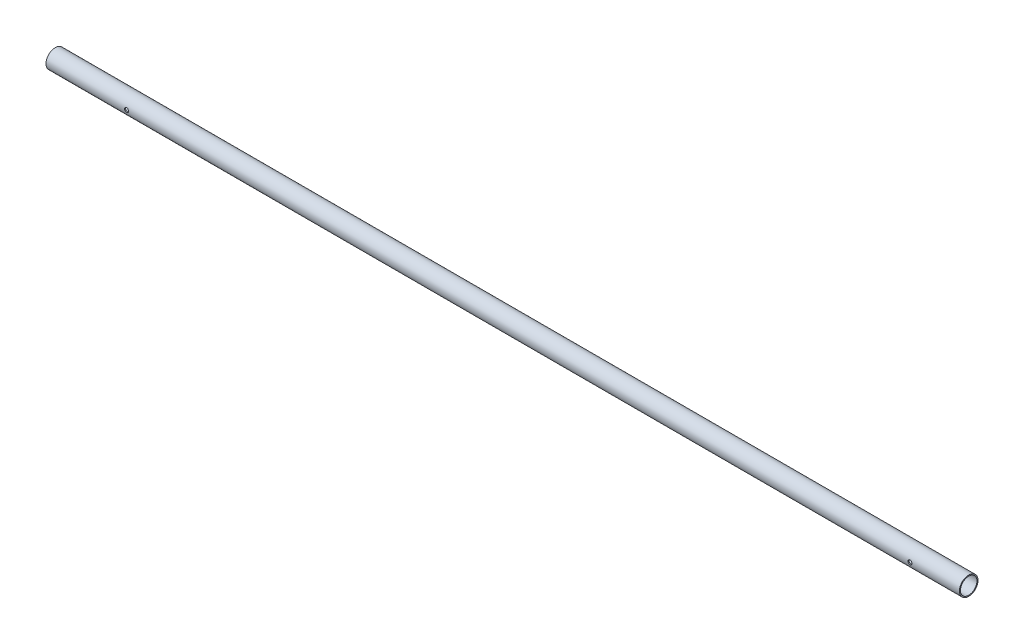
ISO-10303-21;
HEADER;
FILE_DESCRIPTION(('STEP AP214'),'2;1');
FILE_NAME('part.step','',(''),(''),'','','');
FILE_SCHEMA(('AUTOMOTIVE_DESIGN { 1 0 10303 214 1 1 1 1 }'));
ENDSEC;
DATA;
#1=APPLICATION_CONTEXT('core data for automotive mechanical design processes');
#2=APPLICATION_PROTOCOL_DEFINITION('international standard','automotive_design',2000,#1);
#3=PRODUCT_CONTEXT('',#1,'mechanical');
#4=PRODUCT('Part','Part','',(#3));
#5=PRODUCT_RELATED_PRODUCT_CATEGORY('part','',(#4));
#6=PRODUCT_DEFINITION_FORMATION('','',#4);
#7=PRODUCT_DEFINITION_CONTEXT('part definition',#1,'design');
#8=PRODUCT_DEFINITION('design','',#6,#7);
#9=PRODUCT_DEFINITION_SHAPE('','',#8);
#10=(LENGTH_UNIT() NAMED_UNIT(*) SI_UNIT(.MILLI.,.METRE.));
#11=(NAMED_UNIT(*) PLANE_ANGLE_UNIT() SI_UNIT($,.RADIAN.));
#12=(NAMED_UNIT(*) SI_UNIT($,.STERADIAN.) SOLID_ANGLE_UNIT());
#13=UNCERTAINTY_MEASURE_WITH_UNIT(LENGTH_MEASURE(1.E-05),#10,'distance_accuracy_value','');
#14=(GEOMETRIC_REPRESENTATION_CONTEXT(3) GLOBAL_UNCERTAINTY_ASSIGNED_CONTEXT((#13)) GLOBAL_UNIT_ASSIGNED_CONTEXT((#10,
#11,#12)) REPRESENTATION_CONTEXT('',''));
#15=CARTESIAN_POINT('',(0.,0.,0.));
#16=DIRECTION('',(0.,0.,1.));
#17=DIRECTION('',(1.,0.,0.));
#18=AXIS2_PLACEMENT_3D('',#15,#16,#17);
#19=CARTESIAN_POINT('',(936.625,0.,0.));
#20=DIRECTION('',(1.,0.,0.));
#21=DIRECTION('',(0.,0.,-1.));
#22=AXIS2_PLACEMENT_3D('',#19,#20,#21);
#23=PLANE('',#22);
#24=CARTESIAN_POINT('',(936.625,0.,0.));
#25=DIRECTION('',(1.,0.,0.));
#26=DIRECTION('',(0.,0.,-1.));
#27=AXIS2_PLACEMENT_3D('',#24,#25,#26);
#28=CIRCLE('',#27,19.05);
#29=CARTESIAN_POINT('',(936.625,0.,-19.05));
#30=VERTEX_POINT('',#29);
#31=EDGE_CURVE('E10',#30,#30,#28,.T.);
#32=ORIENTED_EDGE('',*,*,#31,.T.);
#33=EDGE_LOOP('',(#32));
#34=FACE_BOUND('',#33,.T.);
#35=CARTESIAN_POINT('',(936.625,0.,0.));
#36=DIRECTION('',(1.,0.,0.));
#37=DIRECTION('',(0.,0.,-1.));
#38=AXIS2_PLACEMENT_3D('',#35,#36,#37);
#39=CIRCLE('',#38,16.9418);
#40=CARTESIAN_POINT('',(936.625,0.,-16.9418));
#41=VERTEX_POINT('',#40);
#42=EDGE_CURVE('E46',#41,#41,#39,.T.);
#43=ORIENTED_EDGE('',*,*,#42,.F.);
#44=EDGE_LOOP('',(#43));
#45=FACE_BOUND('',#44,.T.);
#46=ADVANCED_FACE('F28',(#34,#45),#23,.T.);
#47=CARTESIAN_POINT('',(-936.625,0.,0.));
#48=DIRECTION('',(1.,0.,0.));
#49=DIRECTION('',(0.,0.,-1.));
#50=AXIS2_PLACEMENT_3D('',#47,#48,#49);
#51=PLANE('',#50);
#52=CARTESIAN_POINT('',(-936.625,0.,0.));
#53=DIRECTION('',(1.,0.,0.));
#54=DIRECTION('',(0.,0.,-1.));
#55=AXIS2_PLACEMENT_3D('',#52,#53,#54);
#56=CIRCLE('',#55,19.05);
#57=CARTESIAN_POINT('',(-936.625,0.,-19.05));
#58=VERTEX_POINT('',#57);
#59=EDGE_CURVE('E41',#58,#58,#56,.T.);
#60=ORIENTED_EDGE('',*,*,#59,.F.);
#61=EDGE_LOOP('',(#60));
#62=FACE_BOUND('',#61,.T.);
#63=CARTESIAN_POINT('',(-936.625,0.,0.));
#64=DIRECTION('',(1.,0.,0.));
#65=DIRECTION('',(0.,0.,-1.));
#66=AXIS2_PLACEMENT_3D('',#63,#64,#65);
#67=CIRCLE('',#66,16.9418);
#68=CARTESIAN_POINT('',(-936.625,0.,-16.9418));
#69=VERTEX_POINT('',#68);
#70=EDGE_CURVE('E49',#69,#69,#67,.T.);
#71=ORIENTED_EDGE('',*,*,#70,.T.);
#72=EDGE_LOOP('',(#71));
#73=FACE_BOUND('',#72,.T.);
#74=ADVANCED_FACE('F96',(#62,#73),#51,.F.);
#75=CARTESIAN_POINT('',(936.625,0.,0.));
#76=DIRECTION('',(-1.,0.,0.));
#77=DIRECTION('',(0.,0.,1.));
#78=AXIS2_PLACEMENT_3D('',#75,#76,#77);
#79=CYLINDRICAL_SURFACE('',#78,19.05);
#80=CARTESIAN_POINT('',(839.1906,0.,-19.05));
#81=CARTESIAN_POINT('',(839.190592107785,0.23103670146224,-19.0499957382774));
#82=CARTESIAN_POINT('',(839.171314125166,0.462168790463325,-19.0457543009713));
#83=CARTESIAN_POINT('',(839.09479154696,0.917867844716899,-19.0292440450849));
#84=CARTESIAN_POINT('',(839.037519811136,1.1424299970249,-19.0169694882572));
#85=CARTESIAN_POINT('',(838.886889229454,1.57833749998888,-18.9857596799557));
#86=CARTESIAN_POINT('',(838.7935680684,1.78969638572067,-18.966831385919));
#87=CARTESIAN_POINT('',(838.573607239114,2.19374922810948,-18.9243570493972));
#88=CARTESIAN_POINT('',(838.446968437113,2.38644366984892,-18.9008111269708));
#89=CARTESIAN_POINT('',(838.161817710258,2.75079571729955,-18.8512587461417));
#90=CARTESIAN_POINT('',(838.002873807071,2.92211112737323,-18.8252217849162));
#91=CARTESIAN_POINT('',(837.658552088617,3.23587497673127,-18.7738368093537));
#92=CARTESIAN_POINT('',(837.47317191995,3.37832084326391,-18.748488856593));
#93=CARTESIAN_POINT('',(837.078710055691,3.63181171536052,-18.7010511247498));
#94=CARTESIAN_POINT('',(836.869389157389,3.74249246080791,-18.6790004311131));
#95=CARTESIAN_POINT('',(836.434557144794,3.92697472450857,-18.641091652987));
#96=CARTESIAN_POINT('',(836.209047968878,4.00078064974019,-18.6252328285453));
#97=CARTESIAN_POINT('',(835.751952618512,4.10828734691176,-18.6018140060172));
#98=CARTESIAN_POINT('',(835.520515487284,4.14259395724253,-18.5941287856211));
#99=CARTESIAN_POINT('',(835.055052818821,4.17201195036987,-18.5875512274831));
#100=CARTESIAN_POINT('',(834.821027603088,4.167128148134,-18.5886578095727));
#101=CARTESIAN_POINT('',(834.361535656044,4.11879150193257,-18.5994254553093));
#102=CARTESIAN_POINT('',(834.135990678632,4.07604242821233,-18.6089304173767));
#103=CARTESIAN_POINT('',(833.695353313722,3.95430370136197,-18.6351770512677));
#104=CARTESIAN_POINT('',(833.480261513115,3.87531201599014,-18.651919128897));
#105=CARTESIAN_POINT('',(833.064657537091,3.68268403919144,-18.6909074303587));
#106=CARTESIAN_POINT('',(832.864274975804,3.56877710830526,-18.7131963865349));
#107=CARTESIAN_POINT('',(832.485207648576,3.30974234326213,-18.7607408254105));
#108=CARTESIAN_POINT('',(832.306525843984,3.1646102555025,-18.7859967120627));
#109=CARTESIAN_POINT('',(831.971880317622,2.84351942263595,-18.8372990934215));
#110=CARTESIAN_POINT('',(831.816491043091,2.66696223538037,-18.8633508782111));
#111=CARTESIAN_POINT('',(831.537433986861,2.28999988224,-18.9128125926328));
#112=CARTESIAN_POINT('',(831.413766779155,2.08959428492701,-18.9362224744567));
#113=CARTESIAN_POINT('',(831.201522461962,1.66992291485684,-18.9778386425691));
#114=CARTESIAN_POINT('',(831.11302059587,1.45061790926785,-18.9960337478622));
#115=CARTESIAN_POINT('',(830.974283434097,0.999762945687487,-19.0250871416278));
#116=CARTESIAN_POINT('',(830.924042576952,0.768214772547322,-19.035946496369));
#117=CARTESIAN_POINT('',(830.864089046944,0.304373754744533,-19.0489530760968));
#118=CARTESIAN_POINT('',(830.853591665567,0.0721869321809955,-19.0512689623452));
#119=CARTESIAN_POINT('',(830.871296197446,-0.390622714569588,-19.0474002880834));
#120=CARTESIAN_POINT('',(830.899495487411,-0.621245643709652,-19.0412163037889));
#121=CARTESIAN_POINT('',(830.993142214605,-1.07178121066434,-19.021149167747));
#122=CARTESIAN_POINT('',(831.058178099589,-1.29178351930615,-19.0073511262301));
#123=CARTESIAN_POINT('',(831.223195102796,-1.71775649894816,-18.9736002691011));
#124=CARTESIAN_POINT('',(831.323179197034,-1.92372597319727,-18.9536469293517));
#125=CARTESIAN_POINT('',(831.556889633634,-2.31903151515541,-18.909382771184));
#126=CARTESIAN_POINT('',(831.69107699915,-2.50808836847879,-18.8850138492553));
#127=CARTESIAN_POINT('',(831.988777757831,-2.86128245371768,-18.8347403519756));
#128=CARTESIAN_POINT('',(832.152294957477,-3.02541644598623,-18.8088355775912));
#129=CARTESIAN_POINT('',(832.507614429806,-3.32720776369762,-18.7578275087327));
#130=CARTESIAN_POINT('',(832.699882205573,-3.46432173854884,-18.7327477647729));
#131=CARTESIAN_POINT('',(833.105177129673,-3.70431636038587,-18.6867742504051));
#132=CARTESIAN_POINT('',(833.318203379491,-3.8071984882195,-18.665880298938));
#133=CARTESIAN_POINT('',(833.757826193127,-3.9751144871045,-18.630843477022));
#134=CARTESIAN_POINT('',(833.984338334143,-4.04036109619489,-18.6166627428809));
#135=CARTESIAN_POINT('',(834.445461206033,-4.13177717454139,-18.5965896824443));
#136=CARTESIAN_POINT('',(834.680070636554,-4.15795288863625,-18.5906960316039));
#137=CARTESIAN_POINT('',(835.145249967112,-4.17021848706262,-18.587947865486));
#138=CARTESIAN_POINT('',(835.375796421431,-4.15716987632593,-18.5908990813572));
#139=CARTESIAN_POINT('',(835.831320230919,-4.09328311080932,-18.6050687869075));
#140=CARTESIAN_POINT('',(836.056297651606,-4.04244540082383,-18.6162871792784));
#141=CARTESIAN_POINT('',(836.493613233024,-3.90483964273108,-18.6456325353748));
#142=CARTESIAN_POINT('',(836.705992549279,-3.81819690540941,-18.6637353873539));
#143=CARTESIAN_POINT('',(837.113328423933,-3.61154823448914,-18.704819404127));
#144=CARTESIAN_POINT('',(837.308283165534,-3.49153882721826,-18.7278010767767));
#145=CARTESIAN_POINT('',(837.679482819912,-3.21870570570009,-18.7766336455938));
#146=CARTESIAN_POINT('',(837.855270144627,-3.06526800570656,-18.8025331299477));
#147=CARTESIAN_POINT('',(838.178884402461,-2.73117812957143,-18.8539565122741));
#148=CARTESIAN_POINT('',(838.326704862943,-2.55051967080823,-18.8794803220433));
#149=CARTESIAN_POINT('',(838.59202373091,-2.16429423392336,-18.9276689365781));
#150=CARTESIAN_POINT('',(838.709104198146,-1.95843470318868,-18.9502923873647));
#151=CARTESIAN_POINT('',(838.906816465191,-1.52950710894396,-18.9897163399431));
#152=CARTESIAN_POINT('',(838.987478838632,-1.30645366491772,-19.0065217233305));
#153=CARTESIAN_POINT('',(839.095686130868,-0.902647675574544,-19.0294168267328));
#154=CARTESIAN_POINT('',(839.13121092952,-0.724079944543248,-19.0370877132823));
#155=CARTESIAN_POINT('',(839.178670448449,-0.363694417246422,-19.0473808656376));
#156=CARTESIAN_POINT('',(839.190606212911,-0.181876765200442,-19.0500033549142));
#157=CARTESIAN_POINT('',(839.1906,0.,-19.05));
#158=B_SPLINE_CURVE_WITH_KNOTS('',3,(#80,#81,#82,#83,#84,#85,#86,#87,#88,#89,#90,#91,#92,#93,
#94,#95,#96,#97,#98,#99,#100,#101,#102,#103,#104,#105,#106,#107,#108,#109,#110,#111,#112,#113,
#114,#115,#116,#117,#118,#119,#120,#121,#122,#123,#124,#125,#126,#127,#128,#129,#130,#131,#132,
#133,#134,#135,#136,#137,#138,#139,#140,#141,#142,#143,#144,#145,#146,#147,#148,#149,#150,#151,
#152,#153,#154,#155,#156,#157),.UNSPECIFIED.,.T.,.F.,(4,2,2,2,2,2,2,2,2,2,2,2,2,2,2,2,2,2,2,2,2,
2,2,2,2,2,2,2,2,2,2,2,2,2,2,2,2,2,4),(0.,0.692444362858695,1.3853838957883,2.07760100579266,
2.76980012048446,3.47194888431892,4.17416019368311,4.88412865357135,5.59401224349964,
6.29285621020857,6.99161431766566,7.67765149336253,8.36372714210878,9.05526135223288,
9.74688982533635,10.4534659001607,11.1600547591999,11.8681474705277,12.5761372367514,
13.2700730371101,13.9639617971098,14.6502469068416,15.33659047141,16.0327255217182,
16.7289509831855,17.4380000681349,18.1470184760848,18.8519887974,19.5568464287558,
20.2463368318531,20.9358191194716,21.6229085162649,22.3100694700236,23.0111136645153,
23.7123199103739,24.4226166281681,25.1323159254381,25.6774462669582,26.2225524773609),.UNSPECIFIED.);
#159=CARTESIAN_POINT('',(839.1906,0.,-19.05));
#160=VERTEX_POINT('',#159);
#161=EDGE_CURVE('E163',#160,#160,#158,.T.);
#162=ORIENTED_EDGE('',*,*,#161,.T.);
#163=EDGE_LOOP('',(#162));
#164=FACE_BOUND('',#163,.T.);
#165=CARTESIAN_POINT('',(839.1906,0.,19.05));
#166=CARTESIAN_POINT('',(839.190592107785,-0.23103670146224,19.0499957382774));
#167=CARTESIAN_POINT('',(839.171314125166,-0.462168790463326,19.0457543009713));
#168=CARTESIAN_POINT('',(839.09479154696,-0.917867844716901,19.0292440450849));
#169=CARTESIAN_POINT('',(839.037519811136,-1.1424299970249,19.0169694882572));
#170=CARTESIAN_POINT('',(838.886889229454,-1.57833749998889,18.9857596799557));
#171=CARTESIAN_POINT('',(838.7935680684,-1.78969638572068,18.966831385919));
#172=CARTESIAN_POINT('',(838.573607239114,-2.19374922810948,18.9243570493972));
#173=CARTESIAN_POINT('',(838.446968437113,-2.38644366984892,18.9008111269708));
#174=CARTESIAN_POINT('',(838.161817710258,-2.75079571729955,18.8512587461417));
#175=CARTESIAN_POINT('',(838.002873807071,-2.92211112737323,18.8252217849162));
#176=CARTESIAN_POINT('',(837.658552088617,-3.23587497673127,18.7738368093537));
#177=CARTESIAN_POINT('',(837.47317191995,-3.37832084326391,18.748488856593));
#178=CARTESIAN_POINT('',(837.078710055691,-3.63181171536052,18.7010511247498));
#179=CARTESIAN_POINT('',(836.869389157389,-3.74249246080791,18.6790004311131));
#180=CARTESIAN_POINT('',(836.434557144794,-3.92697472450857,18.641091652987));
#181=CARTESIAN_POINT('',(836.209047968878,-4.00078064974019,18.6252328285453));
#182=CARTESIAN_POINT('',(835.751952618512,-4.10828734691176,18.6018140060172));
#183=CARTESIAN_POINT('',(835.520515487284,-4.14259395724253,18.5941287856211));
#184=CARTESIAN_POINT('',(835.055052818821,-4.17201195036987,18.5875512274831));
#185=CARTESIAN_POINT('',(834.821027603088,-4.167128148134,18.5886578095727));
#186=CARTESIAN_POINT('',(834.361535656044,-4.11879150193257,18.5994254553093));
#187=CARTESIAN_POINT('',(834.135990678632,-4.07604242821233,18.6089304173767));
#188=CARTESIAN_POINT('',(833.695353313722,-3.95430370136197,18.6351770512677));
#189=CARTESIAN_POINT('',(833.480261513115,-3.87531201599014,18.651919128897));
#190=CARTESIAN_POINT('',(833.064657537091,-3.68268403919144,18.6909074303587));
#191=CARTESIAN_POINT('',(832.864274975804,-3.56877710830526,18.7131963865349));
#192=CARTESIAN_POINT('',(832.485207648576,-3.30974234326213,18.7607408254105));
#193=CARTESIAN_POINT('',(832.306525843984,-3.1646102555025,18.7859967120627));
#194=CARTESIAN_POINT('',(831.971880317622,-2.84351942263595,18.8372990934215));
#195=CARTESIAN_POINT('',(831.816491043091,-2.66696223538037,18.8633508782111));
#196=CARTESIAN_POINT('',(831.537433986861,-2.28999988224,18.9128125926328));
#197=CARTESIAN_POINT('',(831.413766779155,-2.08959428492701,18.9362224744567));
#198=CARTESIAN_POINT('',(831.201522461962,-1.66992291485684,18.9778386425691));
#199=CARTESIAN_POINT('',(831.11302059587,-1.45061790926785,18.9960337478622));
#200=CARTESIAN_POINT('',(830.974283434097,-0.999762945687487,19.0250871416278));
#201=CARTESIAN_POINT('',(830.924042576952,-0.768214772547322,19.035946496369));
#202=CARTESIAN_POINT('',(830.864089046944,-0.304373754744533,19.0489530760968));
#203=CARTESIAN_POINT('',(830.853591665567,-0.0721869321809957,19.0512689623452));
#204=CARTESIAN_POINT('',(830.871296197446,0.390622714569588,19.0474002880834));
#205=CARTESIAN_POINT('',(830.899495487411,0.621245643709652,19.0412163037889));
#206=CARTESIAN_POINT('',(830.993142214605,1.07178121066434,19.021149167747));
#207=CARTESIAN_POINT('',(831.058178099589,1.29178351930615,19.0073511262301));
#208=CARTESIAN_POINT('',(831.223195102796,1.71775649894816,18.9736002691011));
#209=CARTESIAN_POINT('',(831.323179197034,1.92372597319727,18.9536469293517));
#210=CARTESIAN_POINT('',(831.556889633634,2.31903151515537,18.909382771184));
#211=CARTESIAN_POINT('',(831.69107699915,2.50808836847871,18.8850138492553));
#212=CARTESIAN_POINT('',(831.988777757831,2.86128245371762,18.8347403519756));
#213=CARTESIAN_POINT('',(832.152294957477,3.0254164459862,18.8088355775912));
#214=CARTESIAN_POINT('',(832.507614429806,3.32720776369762,18.7578275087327));
#215=CARTESIAN_POINT('',(832.699882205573,3.46432173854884,18.7327477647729));
#216=CARTESIAN_POINT('',(833.105177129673,3.70431636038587,18.6867742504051));
#217=CARTESIAN_POINT('',(833.318203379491,3.8071984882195,18.665880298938));
#218=CARTESIAN_POINT('',(833.757826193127,3.9751144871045,18.630843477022));
#219=CARTESIAN_POINT('',(833.984338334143,4.04036109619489,18.6166627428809));
#220=CARTESIAN_POINT('',(834.445461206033,4.13177717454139,18.5965896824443));
#221=CARTESIAN_POINT('',(834.680070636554,4.15795288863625,18.5906960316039));
#222=CARTESIAN_POINT('',(835.145249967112,4.17021848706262,18.587947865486));
#223=CARTESIAN_POINT('',(835.375796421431,4.15716987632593,18.5908990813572));
#224=CARTESIAN_POINT('',(835.831320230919,4.09328311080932,18.6050687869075));
#225=CARTESIAN_POINT('',(836.056297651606,4.04244540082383,18.6162871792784));
#226=CARTESIAN_POINT('',(836.493613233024,3.90483964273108,18.6456325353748));
#227=CARTESIAN_POINT('',(836.705992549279,3.81819690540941,18.6637353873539));
#228=CARTESIAN_POINT('',(837.113328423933,3.61154823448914,18.704819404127));
#229=CARTESIAN_POINT('',(837.308283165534,3.49153882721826,18.7278010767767));
#230=CARTESIAN_POINT('',(837.679482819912,3.21870570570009,18.7766336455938));
#231=CARTESIAN_POINT('',(837.855270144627,3.06526800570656,18.8025331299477));
#232=CARTESIAN_POINT('',(838.178884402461,2.73117812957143,18.8539565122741));
#233=CARTESIAN_POINT('',(838.326704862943,2.55051967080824,18.8794803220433));
#234=CARTESIAN_POINT('',(838.59202373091,2.16429423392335,18.9276689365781));
#235=CARTESIAN_POINT('',(838.709104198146,1.95843470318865,18.9502923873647));
#236=CARTESIAN_POINT('',(838.906816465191,1.52950710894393,18.9897163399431));
#237=CARTESIAN_POINT('',(838.987478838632,1.30645366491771,19.0065217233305));
#238=CARTESIAN_POINT('',(839.095686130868,0.902647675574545,19.0294168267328));
#239=CARTESIAN_POINT('',(839.13121092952,0.724079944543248,19.0370877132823));
#240=CARTESIAN_POINT('',(839.178670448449,0.363694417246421,19.0473808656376));
#241=CARTESIAN_POINT('',(839.190606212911,0.181876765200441,19.0500033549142));
#242=CARTESIAN_POINT('',(839.1906,0.,19.05));
#243=B_SPLINE_CURVE_WITH_KNOTS('',3,(#165,#166,#167,#168,#169,#170,#171,#172,#173,#174,#175,
#176,#177,#178,#179,#180,#181,#182,#183,#184,#185,#186,#187,#188,#189,#190,#191,#192,#193,#194,
#195,#196,#197,#198,#199,#200,#201,#202,#203,#204,#205,#206,#207,#208,#209,#210,#211,#212,#213,
#214,#215,#216,#217,#218,#219,#220,#221,#222,#223,#224,#225,#226,#227,#228,#229,#230,#231,#232,
#233,#234,#235,#236,#237,#238,#239,#240,#241,#242),.UNSPECIFIED.,.T.,.F.,(4,2,2,2,2,2,2,2,2,2,2,
2,2,2,2,2,2,2,2,2,2,2,2,2,2,2,2,2,2,2,2,2,2,2,2,2,2,2,4),(0.,0.692444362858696,1.3853838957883,
2.07760100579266,2.76980012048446,3.47194888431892,4.17416019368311,4.88412865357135,
5.59401224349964,6.29285621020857,6.99161431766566,7.67765149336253,8.36372714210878,
9.05526135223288,9.74688982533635,10.4534659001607,11.1600547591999,11.8681474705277,
12.5761372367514,13.2700730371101,13.9639617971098,14.6502469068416,15.33659047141,
16.0327255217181,16.7289509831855,17.4380000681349,18.1470184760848,18.8519887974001,
19.5568464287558,20.2463368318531,20.9358191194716,21.6229085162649,22.3100694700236,
23.0111136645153,23.7123199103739,24.4226166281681,25.1323159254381,25.6774462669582,
26.2225524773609),.UNSPECIFIED.);
#244=CARTESIAN_POINT('',(839.1906,0.,19.05));
#245=VERTEX_POINT('',#244);
#246=EDGE_CURVE('E59',#245,#245,#243,.T.);
#247=ORIENTED_EDGE('',*,*,#246,.T.);
#248=EDGE_LOOP('',(#247));
#249=FACE_BOUND('',#248,.T.);
#250=CARTESIAN_POINT('',(-767.3594,0.,-19.05));
#251=CARTESIAN_POINT('',(-767.359407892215,0.23103670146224,-19.0499957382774));
#252=CARTESIAN_POINT('',(-767.378685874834,0.462168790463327,-19.0457543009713));
#253=CARTESIAN_POINT('',(-767.45520845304,0.917867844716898,-19.0292440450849));
#254=CARTESIAN_POINT('',(-767.512480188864,1.14242999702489,-19.0169694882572));
#255=CARTESIAN_POINT('',(-767.663110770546,1.57833749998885,-18.9857596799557));
#256=CARTESIAN_POINT('',(-767.7564319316,1.78969638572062,-18.966831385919));
#257=CARTESIAN_POINT('',(-767.976392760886,2.19374922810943,-18.9243570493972));
#258=CARTESIAN_POINT('',(-768.103031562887,2.38644366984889,-18.9008111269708));
#259=CARTESIAN_POINT('',(-768.388182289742,2.75079571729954,-18.8512587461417));
#260=CARTESIAN_POINT('',(-768.547126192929,2.92211112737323,-18.8252217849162));
#261=CARTESIAN_POINT('',(-768.891447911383,3.23587497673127,-18.7738368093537));
#262=CARTESIAN_POINT('',(-769.076828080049,3.37832084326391,-18.748488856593));
#263=CARTESIAN_POINT('',(-769.471289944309,3.63181171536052,-18.7010511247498));
#264=CARTESIAN_POINT('',(-769.680610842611,3.74249246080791,-18.6790004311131));
#265=CARTESIAN_POINT('',(-770.115442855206,3.92697472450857,-18.641091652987));
#266=CARTESIAN_POINT('',(-770.340952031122,4.00078064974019,-18.6252328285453));
#267=CARTESIAN_POINT('',(-770.798047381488,4.10828734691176,-18.6018140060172));
#268=CARTESIAN_POINT('',(-771.029484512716,4.14259395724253,-18.5941287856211));
#269=CARTESIAN_POINT('',(-771.494947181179,4.17201195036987,-18.5875512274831));
#270=CARTESIAN_POINT('',(-771.728972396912,4.167128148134,-18.5886578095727));
#271=CARTESIAN_POINT('',(-772.188464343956,4.11879150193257,-18.5994254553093));
#272=CARTESIAN_POINT('',(-772.414009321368,4.07604242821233,-18.6089304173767));
#273=CARTESIAN_POINT('',(-772.854646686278,3.95430370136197,-18.6351770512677));
#274=CARTESIAN_POINT('',(-773.069738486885,3.87531201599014,-18.651919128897));
#275=CARTESIAN_POINT('',(-773.485342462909,3.68268403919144,-18.6909074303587));
#276=CARTESIAN_POINT('',(-773.685725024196,3.56877710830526,-18.7131963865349));
#277=CARTESIAN_POINT('',(-774.064792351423,3.30974234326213,-18.7607408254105));
#278=CARTESIAN_POINT('',(-774.243474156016,3.1646102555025,-18.7859967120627));
#279=CARTESIAN_POINT('',(-774.578119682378,2.84351942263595,-18.8372990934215));
#280=CARTESIAN_POINT('',(-774.733508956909,2.66696223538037,-18.8633508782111));
#281=CARTESIAN_POINT('',(-775.012566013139,2.28999988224,-18.9128125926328));
#282=CARTESIAN_POINT('',(-775.136233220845,2.08959428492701,-18.9362224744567));
#283=CARTESIAN_POINT('',(-775.348477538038,1.66992291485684,-18.9778386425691));
#284=CARTESIAN_POINT('',(-775.43697940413,1.45061790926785,-18.9960337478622));
#285=CARTESIAN_POINT('',(-775.575716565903,0.999762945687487,-19.0250871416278));
#286=CARTESIAN_POINT('',(-775.625957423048,0.768214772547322,-19.035946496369));
#287=CARTESIAN_POINT('',(-775.685910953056,0.304373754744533,-19.0489530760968));
#288=CARTESIAN_POINT('',(-775.696408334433,0.0721869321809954,-19.0512689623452));
#289=CARTESIAN_POINT('',(-775.678703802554,-0.390622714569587,-19.0474002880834));
#290=CARTESIAN_POINT('',(-775.650504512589,-0.621245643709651,-19.0412163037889));
#291=CARTESIAN_POINT('',(-775.556857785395,-1.07178121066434,-19.021149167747));
#292=CARTESIAN_POINT('',(-775.491821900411,-1.29178351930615,-19.0073511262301));
#293=CARTESIAN_POINT('',(-775.326804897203,-1.71775649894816,-18.9736002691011));
#294=CARTESIAN_POINT('',(-775.226820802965,-1.92372597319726,-18.9536469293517));
#295=CARTESIAN_POINT('',(-774.993110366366,-2.31903151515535,-18.909382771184));
#296=CARTESIAN_POINT('',(-774.85892300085,-2.50808836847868,-18.8850138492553));
#297=CARTESIAN_POINT('',(-774.561222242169,-2.86128245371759,-18.8347403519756));
#298=CARTESIAN_POINT('',(-774.397705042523,-3.02541644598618,-18.8088355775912));
#299=CARTESIAN_POINT('',(-774.042385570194,-3.32720776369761,-18.7578275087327));
#300=CARTESIAN_POINT('',(-773.850117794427,-3.46432173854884,-18.7327477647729));
#301=CARTESIAN_POINT('',(-773.444822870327,-3.70431636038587,-18.6867742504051));
#302=CARTESIAN_POINT('',(-773.231796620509,-3.8071984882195,-18.665880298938));
#303=CARTESIAN_POINT('',(-772.792173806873,-3.9751144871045,-18.630843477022));
#304=CARTESIAN_POINT('',(-772.565661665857,-4.04036109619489,-18.6166627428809));
#305=CARTESIAN_POINT('',(-772.104538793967,-4.13177717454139,-18.5965896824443));
#306=CARTESIAN_POINT('',(-771.869929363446,-4.15795288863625,-18.5906960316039));
#307=CARTESIAN_POINT('',(-771.404750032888,-4.17021848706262,-18.587947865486));
#308=CARTESIAN_POINT('',(-771.174203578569,-4.15716987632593,-18.5908990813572));
#309=CARTESIAN_POINT('',(-770.718679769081,-4.09328311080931,-18.6050687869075));
#310=CARTESIAN_POINT('',(-770.493702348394,-4.04244540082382,-18.6162871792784));
#311=CARTESIAN_POINT('',(-770.056386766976,-3.90483964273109,-18.6456325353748));
#312=CARTESIAN_POINT('',(-769.844007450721,-3.81819690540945,-18.6637353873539));
#313=CARTESIAN_POINT('',(-769.436671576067,-3.61154823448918,-18.704819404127));
#314=CARTESIAN_POINT('',(-769.241716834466,-3.49153882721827,-18.7278010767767));
#315=CARTESIAN_POINT('',(-768.870517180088,-3.21870570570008,-18.7766336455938));
#316=CARTESIAN_POINT('',(-768.694729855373,-3.06526800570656,-18.8025331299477));
#317=CARTESIAN_POINT('',(-768.371115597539,-2.73117812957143,-18.8539565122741));
#318=CARTESIAN_POINT('',(-768.223295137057,-2.55051967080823,-18.8794803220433));
#319=CARTESIAN_POINT('',(-767.95797626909,-2.16429423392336,-18.9276689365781));
#320=CARTESIAN_POINT('',(-767.840895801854,-1.95843470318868,-18.9502923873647));
#321=CARTESIAN_POINT('',(-767.643183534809,-1.52950710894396,-18.9897163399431));
#322=CARTESIAN_POINT('',(-767.562521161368,-1.30645366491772,-19.0065217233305));
#323=CARTESIAN_POINT('',(-767.454313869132,-0.902647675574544,-19.0294168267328));
#324=CARTESIAN_POINT('',(-767.418789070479,-0.724079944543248,-19.0370877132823));
#325=CARTESIAN_POINT('',(-767.371329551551,-0.363694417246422,-19.0473808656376));
#326=CARTESIAN_POINT('',(-767.359393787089,-0.181876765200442,-19.0500033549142));
#327=CARTESIAN_POINT('',(-767.3594,0.,-19.05));
#328=B_SPLINE_CURVE_WITH_KNOTS('',3,(#250,#251,#252,#253,#254,#255,#256,#257,#258,#259,#260,
#261,#262,#263,#264,#265,#266,#267,#268,#269,#270,#271,#272,#273,#274,#275,#276,#277,#278,#279,
#280,#281,#282,#283,#284,#285,#286,#287,#288,#289,#290,#291,#292,#293,#294,#295,#296,#297,#298,
#299,#300,#301,#302,#303,#304,#305,#306,#307,#308,#309,#310,#311,#312,#313,#314,#315,#316,#317,
#318,#319,#320,#321,#322,#323,#324,#325,#326,#327),.UNSPECIFIED.,.T.,.F.,(4,2,2,2,2,2,2,2,2,2,2,
2,2,2,2,2,2,2,2,2,2,2,2,2,2,2,2,2,2,2,2,2,2,2,2,2,2,2,4),(0.,0.692444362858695,1.3853838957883,
2.07760100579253,2.76980012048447,3.47194888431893,4.17416019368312,4.88412865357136,
5.59401224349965,6.29285621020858,6.99161431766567,7.67765149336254,8.36372714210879,
9.05526135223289,9.74688982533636,10.4534659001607,11.1600547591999,11.8681474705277,
12.5761372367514,13.2700730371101,13.9639617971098,14.6502469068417,15.33659047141,
16.032725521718,16.7289509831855,17.4380000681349,18.1470184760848,18.8519887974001,
19.5568464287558,20.2463368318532,20.9358191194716,21.6229085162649,22.3100694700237,
23.0111136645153,23.712319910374,24.4226166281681,25.1323159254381,25.6774462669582,
26.2225524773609),.UNSPECIFIED.);
#329=CARTESIAN_POINT('',(-767.3594,0.,-19.05));
#330=VERTEX_POINT('',#329);
#331=EDGE_CURVE('E78',#330,#330,#328,.T.);
#332=ORIENTED_EDGE('',*,*,#331,.T.);
#333=EDGE_LOOP('',(#332));
#334=FACE_BOUND('',#333,.T.);
#335=CARTESIAN_POINT('',(-767.3594,0.,19.05));
#336=CARTESIAN_POINT('',(-767.359407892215,-0.231036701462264,19.0499957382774));
#337=CARTESIAN_POINT('',(-767.378685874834,-0.462168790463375,19.0457543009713));
#338=CARTESIAN_POINT('',(-767.45520845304,-0.917867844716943,19.0292440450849));
#339=CARTESIAN_POINT('',(-767.512480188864,-1.14242999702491,19.0169694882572));
#340=CARTESIAN_POINT('',(-767.663110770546,-1.57833749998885,18.9857596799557));
#341=CARTESIAN_POINT('',(-767.7564319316,-1.78969638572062,18.966831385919));
#342=CARTESIAN_POINT('',(-767.976392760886,-2.19374922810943,18.9243570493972));
#343=CARTESIAN_POINT('',(-768.103031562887,-2.38644366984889,18.9008111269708));
#344=CARTESIAN_POINT('',(-768.388182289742,-2.75079571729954,18.8512587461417));
#345=CARTESIAN_POINT('',(-768.547126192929,-2.92211112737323,18.8252217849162));
#346=CARTESIAN_POINT('',(-768.891447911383,-3.23587497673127,18.7738368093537));
#347=CARTESIAN_POINT('',(-769.076828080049,-3.37832084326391,18.748488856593));
#348=CARTESIAN_POINT('',(-769.471289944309,-3.63181171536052,18.7010511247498));
#349=CARTESIAN_POINT('',(-769.680610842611,-3.74249246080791,18.6790004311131));
#350=CARTESIAN_POINT('',(-770.115442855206,-3.92697472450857,18.641091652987));
#351=CARTESIAN_POINT('',(-770.340952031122,-4.00078064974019,18.6252328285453));
#352=CARTESIAN_POINT('',(-770.798047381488,-4.10828734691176,18.6018140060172));
#353=CARTESIAN_POINT('',(-771.029484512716,-4.14259395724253,18.5941287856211));
#354=CARTESIAN_POINT('',(-771.494947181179,-4.17201195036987,18.5875512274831));
#355=CARTESIAN_POINT('',(-771.728972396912,-4.167128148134,18.5886578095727));
#356=CARTESIAN_POINT('',(-772.188464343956,-4.11879150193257,18.5994254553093));
#357=CARTESIAN_POINT('',(-772.414009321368,-4.07604242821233,18.6089304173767));
#358=CARTESIAN_POINT('',(-772.854646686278,-3.95430370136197,18.6351770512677));
#359=CARTESIAN_POINT('',(-773.069738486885,-3.87531201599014,18.651919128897));
#360=CARTESIAN_POINT('',(-773.485342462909,-3.68268403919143,18.6909074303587));
#361=CARTESIAN_POINT('',(-773.685725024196,-3.56877710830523,18.7131963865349));
#362=CARTESIAN_POINT('',(-774.064792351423,-3.30974234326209,18.7607408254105));
#363=CARTESIAN_POINT('',(-774.243474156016,-3.16461025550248,18.7859967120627));
#364=CARTESIAN_POINT('',(-774.578119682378,-2.84351942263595,18.8372990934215));
#365=CARTESIAN_POINT('',(-774.733508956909,-2.66696223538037,18.8633508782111));
#366=CARTESIAN_POINT('',(-775.012566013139,-2.28999988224,18.9128125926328));
#367=CARTESIAN_POINT('',(-775.136233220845,-2.08959428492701,18.9362224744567));
#368=CARTESIAN_POINT('',(-775.348477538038,-1.66992291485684,18.9778386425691));
#369=CARTESIAN_POINT('',(-775.43697940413,-1.45061790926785,18.9960337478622));
#370=CARTESIAN_POINT('',(-775.575716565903,-0.999762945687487,19.0250871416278));
#371=CARTESIAN_POINT('',(-775.625957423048,-0.768214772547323,19.035946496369));
#372=CARTESIAN_POINT('',(-775.685910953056,-0.304373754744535,19.0489530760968));
#373=CARTESIAN_POINT('',(-775.696408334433,-0.0721869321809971,19.0512689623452));
#374=CARTESIAN_POINT('',(-775.678703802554,0.390622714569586,19.0474002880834));
#375=CARTESIAN_POINT('',(-775.650504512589,0.621245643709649,19.0412163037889));
#376=CARTESIAN_POINT('',(-775.556857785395,1.07178121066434,19.021149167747));
#377=CARTESIAN_POINT('',(-775.491821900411,1.29178351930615,19.0073511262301));
#378=CARTESIAN_POINT('',(-775.326804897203,1.71775649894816,18.9736002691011));
#379=CARTESIAN_POINT('',(-775.226820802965,1.92372597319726,18.9536469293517));
#380=CARTESIAN_POINT('',(-774.993110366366,2.31903151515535,18.909382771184));
#381=CARTESIAN_POINT('',(-774.85892300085,2.50808836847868,18.8850138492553));
#382=CARTESIAN_POINT('',(-774.561222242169,2.86128245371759,18.8347403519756));
#383=CARTESIAN_POINT('',(-774.397705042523,3.02541644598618,18.8088355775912));
#384=CARTESIAN_POINT('',(-774.042385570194,3.32720776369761,18.7578275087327));
#385=CARTESIAN_POINT('',(-773.850117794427,3.46432173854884,18.7327477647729));
#386=CARTESIAN_POINT('',(-773.444822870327,3.70431636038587,18.6867742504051));
#387=CARTESIAN_POINT('',(-773.231796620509,3.8071984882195,18.665880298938));
#388=CARTESIAN_POINT('',(-772.792173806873,3.9751144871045,18.630843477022));
#389=CARTESIAN_POINT('',(-772.565661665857,4.04036109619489,18.6166627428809));
#390=CARTESIAN_POINT('',(-772.104538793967,4.13177717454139,18.5965896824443));
#391=CARTESIAN_POINT('',(-771.869929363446,4.15795288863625,18.5906960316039));
#392=CARTESIAN_POINT('',(-771.404750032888,4.17021848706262,18.587947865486));
#393=CARTESIAN_POINT('',(-771.174203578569,4.15716987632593,18.5908990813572));
#394=CARTESIAN_POINT('',(-770.718679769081,4.09328311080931,18.6050687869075));
#395=CARTESIAN_POINT('',(-770.493702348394,4.04244540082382,18.6162871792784));
#396=CARTESIAN_POINT('',(-770.056386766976,3.90483964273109,18.6456325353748));
#397=CARTESIAN_POINT('',(-769.844007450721,3.81819690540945,18.6637353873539));
#398=CARTESIAN_POINT('',(-769.436671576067,3.61154823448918,18.704819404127));
#399=CARTESIAN_POINT('',(-769.241716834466,3.49153882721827,18.7278010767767));
#400=CARTESIAN_POINT('',(-768.870517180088,3.21870570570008,18.7766336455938));
#401=CARTESIAN_POINT('',(-768.694729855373,3.06526800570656,18.8025331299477));
#402=CARTESIAN_POINT('',(-768.371115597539,2.73117812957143,18.8539565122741));
#403=CARTESIAN_POINT('',(-768.223295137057,2.55051967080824,18.8794803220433));
#404=CARTESIAN_POINT('',(-767.95797626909,2.16429423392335,18.9276689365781));
#405=CARTESIAN_POINT('',(-767.840895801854,1.95843470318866,18.9502923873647));
#406=CARTESIAN_POINT('',(-767.643183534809,1.52950710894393,18.9897163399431));
#407=CARTESIAN_POINT('',(-767.562521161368,1.30645366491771,19.0065217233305));
#408=CARTESIAN_POINT('',(-767.454313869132,0.902647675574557,19.0294168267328));
#409=CARTESIAN_POINT('',(-767.418789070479,0.724079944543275,19.0370877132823));
#410=CARTESIAN_POINT('',(-767.371329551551,0.36369441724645,19.0473808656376));
#411=CARTESIAN_POINT('',(-767.359393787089,0.181876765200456,19.0500033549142));
#412=CARTESIAN_POINT('',(-767.3594,0.,19.05));
#413=B_SPLINE_CURVE_WITH_KNOTS('',3,(#335,#336,#337,#338,#339,#340,#341,#342,#343,#344,#345,
#346,#347,#348,#349,#350,#351,#352,#353,#354,#355,#356,#357,#358,#359,#360,#361,#362,#363,#364,
#365,#366,#367,#368,#369,#370,#371,#372,#373,#374,#375,#376,#377,#378,#379,#380,#381,#382,#383,
#384,#385,#386,#387,#388,#389,#390,#391,#392,#393,#394,#395,#396,#397,#398,#399,#400,#401,#402,
#403,#404,#405,#406,#407,#408,#409,#410,#411,#412),.UNSPECIFIED.,.T.,.F.,(4,2,2,2,2,2,2,2,2,2,2,
2,2,2,2,2,2,2,2,2,2,2,2,2,2,2,2,2,2,2,2,2,2,2,2,2,2,2,4),(0.,0.692444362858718,1.38538389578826,
2.0776010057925,2.76980012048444,3.47194888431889,4.17416019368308,4.88412865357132,
5.59401224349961,6.29285621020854,6.99161431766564,7.6776514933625,8.36372714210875,
9.05526135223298,9.74688982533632,10.4534659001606,11.1600547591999,11.8681474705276,
12.5761372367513,13.2700730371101,13.9639617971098,14.6502469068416,15.33659047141,
16.0327255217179,16.7289509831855,17.4380000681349,18.1470184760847,18.8519887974,
19.5568464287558,20.2463368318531,20.9358191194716,21.6229085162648,22.3100694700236,
23.0111136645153,23.7123199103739,24.4226166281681,25.1323159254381,25.6774462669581,
26.2225524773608),.UNSPECIFIED.);
#414=CARTESIAN_POINT('',(-767.3594,0.,19.05));
#415=VERTEX_POINT('',#414);
#416=EDGE_CURVE('E83',#415,#415,#413,.T.);
#417=ORIENTED_EDGE('',*,*,#416,.T.);
#418=EDGE_LOOP('',(#417));
#419=FACE_BOUND('',#418,.T.);
#420=ORIENTED_EDGE('',*,*,#31,.F.);
#421=EDGE_LOOP('',(#420));
#422=FACE_BOUND('',#421,.T.);
#423=ORIENTED_EDGE('',*,*,#59,.T.);
#424=EDGE_LOOP('',(#423));
#425=FACE_BOUND('',#424,.T.);
#426=ADVANCED_FACE('F30',(#164,#249,#334,#419,#422,#425),#79,.T.);
#427=CARTESIAN_POINT('',(936.625,0.,0.));
#428=DIRECTION('',(-1.,0.,0.));
#429=DIRECTION('',(0.,0.,1.));
#430=AXIS2_PLACEMENT_3D('',#427,#428,#429);
#431=CYLINDRICAL_SURFACE('',#430,16.9418);
#432=CARTESIAN_POINT('',(839.1906,0.,16.9418));
#433=CARTESIAN_POINT('',(839.190593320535,-0.230274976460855,16.941796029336));
#434=CARTESIAN_POINT('',(839.17144127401,-0.460625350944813,16.9370582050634));
#435=CARTESIAN_POINT('',(839.095448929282,-0.914732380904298,16.9186169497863));
#436=CARTESIAN_POINT('',(839.038586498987,-1.13848508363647,16.9049082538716));
#437=CARTESIAN_POINT('',(838.889101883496,-1.57277279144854,16.8700444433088));
#438=CARTESIAN_POINT('',(838.796521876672,-1.78332304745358,16.8488981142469));
#439=CARTESIAN_POINT('',(838.578376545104,-2.18590314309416,16.8014152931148));
#440=CARTESIAN_POINT('',(838.452810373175,-2.37793250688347,16.7750786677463));
#441=CARTESIAN_POINT('',(838.169607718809,-2.7418556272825,16.719490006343));
#442=CARTESIAN_POINT('',(838.011436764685,-2.91332679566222,16.6901941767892));
#443=CARTESIAN_POINT('',(837.668659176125,-3.22759440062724,16.6322822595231));
#444=CARTESIAN_POINT('',(837.484049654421,-3.37038770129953,16.6036662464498));
#445=CARTESIAN_POINT('',(837.090375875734,-3.62521647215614,16.5499138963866));
#446=CARTESIAN_POINT('',(836.880999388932,-3.73678240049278,16.5248332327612));
#447=CARTESIAN_POINT('',(836.445747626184,-3.92297101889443,16.4816286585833));
#448=CARTESIAN_POINT('',(836.219874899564,-3.99759940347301,16.4635036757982));
#449=CARTESIAN_POINT('',(835.762680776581,-4.10635909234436,16.4367122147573));
#450=CARTESIAN_POINT('',(835.531550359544,-4.14124865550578,16.4278688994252));
#451=CARTESIAN_POINT('',(835.066560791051,-4.17190162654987,16.4201124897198));
#452=CARTESIAN_POINT('',(834.83270207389,-4.16767117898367,16.4211978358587));
#453=CARTESIAN_POINT('',(834.37468094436,-4.12080991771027,16.433016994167));
#454=CARTESIAN_POINT('',(834.150419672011,-4.07907942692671,16.4435245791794));
#455=CARTESIAN_POINT('',(833.712182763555,-3.95983749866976,16.4726441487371));
#456=CARTESIAN_POINT('',(833.498207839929,-3.88232358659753,16.491256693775));
#457=CARTESIAN_POINT('',(833.084187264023,-3.69293976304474,16.5346987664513));
#458=CARTESIAN_POINT('',(832.884298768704,-3.58074042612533,16.5595874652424));
#459=CARTESIAN_POINT('',(832.505862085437,-3.32540123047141,16.6127437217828));
#460=CARTESIAN_POINT('',(832.327317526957,-3.18225612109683,16.6410118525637));
#461=CARTESIAN_POINT('',(831.991474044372,-2.86441092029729,16.6986969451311));
#462=CARTESIAN_POINT('',(831.834895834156,-2.68895022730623,16.7281241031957));
#463=CARTESIAN_POINT('',(831.553252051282,-2.3139109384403,16.7841084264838));
#464=CARTESIAN_POINT('',(831.428187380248,-2.11433165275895,16.8106655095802));
#465=CARTESIAN_POINT('',(831.212868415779,-1.69571292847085,16.8580426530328));
#466=CARTESIAN_POINT('',(831.122728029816,-1.47661263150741,16.8788438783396));
#467=CARTESIAN_POINT('',(830.980756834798,-1.02574438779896,16.9122282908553));
#468=CARTESIAN_POINT('',(830.928918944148,-0.793978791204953,16.9248129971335));
#469=CARTESIAN_POINT('',(830.86611758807,-0.330523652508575,16.9401228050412));
#470=CARTESIAN_POINT('',(830.854172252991,-0.0989747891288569,16.9430847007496));
#471=CARTESIAN_POINT('',(830.868806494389,0.362812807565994,16.9394880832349));
#472=CARTESIAN_POINT('',(830.895382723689,0.593051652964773,16.9329303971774));
#473=CARTESIAN_POINT('',(830.985495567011,1.04229366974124,16.9111828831));
#474=CARTESIAN_POINT('',(831.048499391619,1.26141028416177,16.8961175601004));
#475=CARTESIAN_POINT('',(831.209072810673,1.68595505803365,16.859050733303));
#476=CARTESIAN_POINT('',(831.306645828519,1.89138185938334,16.8370485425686));
#477=CARTESIAN_POINT('',(831.535510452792,2.28664372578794,16.7879788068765));
#478=CARTESIAN_POINT('',(831.667355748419,2.47614790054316,16.7608302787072));
#479=CARTESIAN_POINT('',(831.960311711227,2.83069091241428,16.7046117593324));
#480=CARTESIAN_POINT('',(832.121427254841,2.99572566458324,16.6755414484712));
#481=CARTESIAN_POINT('',(832.472902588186,3.30066899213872,16.6179080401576));
#482=CARTESIAN_POINT('',(832.663864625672,3.43988990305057,16.5893732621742));
#483=CARTESIAN_POINT('',(833.067023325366,3.68430580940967,16.5368125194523));
#484=CARTESIAN_POINT('',(833.279219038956,3.78950232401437,16.5127863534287));
#485=CARTESIAN_POINT('',(833.717673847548,3.96210606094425,16.4722241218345));
#486=CARTESIAN_POINT('',(833.943840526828,4.02973710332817,16.4556438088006));
#487=CARTESIAN_POINT('',(834.404801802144,4.12589135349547,16.4318017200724));
#488=CARTESIAN_POINT('',(834.639594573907,4.15442278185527,16.424537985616));
#489=CARTESIAN_POINT('',(835.104154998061,4.17114904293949,16.4202972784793));
#490=CARTESIAN_POINT('',(835.333881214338,4.16044162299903,16.4230403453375));
#491=CARTESIAN_POINT('',(835.788145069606,4.10149840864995,16.4378588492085));
#492=CARTESIAN_POINT('',(836.012682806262,4.05326332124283,16.4499341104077));
#493=CARTESIAN_POINT('',(836.449047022,3.92122438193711,16.481903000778));
#494=CARTESIAN_POINT('',(836.66093730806,3.83762004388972,16.5017527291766));
#495=CARTESIAN_POINT('',(837.067832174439,3.63737484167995,16.5470415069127));
#496=CARTESIAN_POINT('',(837.262834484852,3.52072954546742,16.5724813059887));
#497=CARTESIAN_POINT('',(837.635737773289,3.25424448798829,16.6268874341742));
#498=CARTESIAN_POINT('',(837.813081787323,3.10364009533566,16.6559266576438));
#499=CARTESIAN_POINT('',(838.140337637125,2.77501047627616,16.7138173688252));
#500=CARTESIAN_POINT('',(838.290242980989,2.5969787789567,16.7426688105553));
#501=CARTESIAN_POINT('',(838.560898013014,2.21481826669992,16.7975304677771));
#502=CARTESIAN_POINT('',(838.681096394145,2.01029006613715,16.8234826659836));
#503=CARTESIAN_POINT('',(838.885212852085,1.58331381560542,16.8690144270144));
#504=CARTESIAN_POINT('',(838.969157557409,1.36087906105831,16.8885986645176));
#505=CARTESIAN_POINT('',(839.085569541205,0.948956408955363,16.9162078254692));
#506=CARTESIAN_POINT('',(839.124872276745,0.761471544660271,16.9257398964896));
#507=CARTESIAN_POINT('',(839.177389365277,0.382674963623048,16.9385374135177));
#508=CARTESIAN_POINT('',(839.190605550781,0.191363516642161,16.9418032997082));
#509=CARTESIAN_POINT('',(839.1906,0.,16.9418));
#510=B_SPLINE_CURVE_WITH_KNOTS('',3,(#432,#433,#434,#435,#436,#437,#438,#439,#440,#441,#442,
#443,#444,#445,#446,#447,#448,#449,#450,#451,#452,#453,#454,#455,#456,#457,#458,#459,#460,#461,
#462,#463,#464,#465,#466,#467,#468,#469,#470,#471,#472,#473,#474,#475,#476,#477,#478,#479,#480,
#481,#482,#483,#484,#485,#486,#487,#488,#489,#490,#491,#492,#493,#494,#495,#496,#497,#498,#499,
#500,#501,#502,#503,#504,#505,#506,#507,#508,#509),.UNSPECIFIED.,.T.,.F.,(4,2,2,2,2,2,2,2,2,2,2,
2,2,2,2,2,2,2,2,2,2,2,2,2,2,2,2,2,2,2,2,2,2,2,2,2,2,2,4),(0.,0.690123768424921,1.38065292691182,
2.07036913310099,2.76010305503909,3.46219936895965,4.16437241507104,4.87659671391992,
5.58871117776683,6.28699731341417,6.98517377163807,7.66702306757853,8.34891952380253,
9.03750232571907,9.72620205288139,10.4338728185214,11.1415638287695,11.851543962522,
12.561392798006,13.2536361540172,13.9458193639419,14.6281259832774,15.3105001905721,
16.0046695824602,16.6989547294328,17.4096833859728,18.1203803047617,18.8267960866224,
19.5330633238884,20.2197247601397,20.9063732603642,21.5891990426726,22.2721164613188,
22.9722985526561,23.6726460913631,24.3851514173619,25.0971325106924,25.670680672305,
26.2441885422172),.UNSPECIFIED.);
#511=CARTESIAN_POINT('',(839.1906,0.,16.9418));
#512=VERTEX_POINT('',#511);
#513=EDGE_CURVE('E33',#512,#512,#510,.T.);
#514=ORIENTED_EDGE('',*,*,#513,.F.);
#515=EDGE_LOOP('',(#514));
#516=FACE_BOUND('',#515,.T.);
#517=CARTESIAN_POINT('',(839.1906,0.,-16.9418));
#518=CARTESIAN_POINT('',(839.190593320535,0.230274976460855,-16.941796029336));
#519=CARTESIAN_POINT('',(839.17144127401,0.460625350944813,-16.9370582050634));
#520=CARTESIAN_POINT('',(839.095448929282,0.914732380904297,-16.9186169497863));
#521=CARTESIAN_POINT('',(839.038586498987,1.13848508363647,-16.9049082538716));
#522=CARTESIAN_POINT('',(838.889101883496,1.57277279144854,-16.8700444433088));
#523=CARTESIAN_POINT('',(838.796521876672,1.78332304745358,-16.8488981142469));
#524=CARTESIAN_POINT('',(838.578376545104,2.18590314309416,-16.8014152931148));
#525=CARTESIAN_POINT('',(838.452810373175,2.37793250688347,-16.7750786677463));
#526=CARTESIAN_POINT('',(838.169607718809,2.7418556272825,-16.719490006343));
#527=CARTESIAN_POINT('',(838.011436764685,2.91332679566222,-16.6901941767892));
#528=CARTESIAN_POINT('',(837.668659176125,3.22759440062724,-16.6322822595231));
#529=CARTESIAN_POINT('',(837.484049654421,3.37038770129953,-16.6036662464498));
#530=CARTESIAN_POINT('',(837.090375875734,3.62521647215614,-16.5499138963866));
#531=CARTESIAN_POINT('',(836.880999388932,3.73678240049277,-16.5248332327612));
#532=CARTESIAN_POINT('',(836.445747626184,3.92297101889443,-16.4816286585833));
#533=CARTESIAN_POINT('',(836.219874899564,3.99759940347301,-16.4635036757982));
#534=CARTESIAN_POINT('',(835.762680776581,4.10635909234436,-16.4367122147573));
#535=CARTESIAN_POINT('',(835.531550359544,4.14124865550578,-16.4278688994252));
#536=CARTESIAN_POINT('',(835.066560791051,4.17190162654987,-16.4201124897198));
#537=CARTESIAN_POINT('',(834.83270207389,4.16767117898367,-16.4211978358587));
#538=CARTESIAN_POINT('',(834.37468094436,4.12080991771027,-16.433016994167));
#539=CARTESIAN_POINT('',(834.150419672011,4.07907942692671,-16.4435245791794));
#540=CARTESIAN_POINT('',(833.712182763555,3.95983749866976,-16.4726441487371));
#541=CARTESIAN_POINT('',(833.498207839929,3.88232358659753,-16.491256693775));
#542=CARTESIAN_POINT('',(833.084187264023,3.69293976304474,-16.5346987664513));
#543=CARTESIAN_POINT('',(832.884298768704,3.58074042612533,-16.5595874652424));
#544=CARTESIAN_POINT('',(832.505862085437,3.32540123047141,-16.6127437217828));
#545=CARTESIAN_POINT('',(832.327317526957,3.18225612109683,-16.6410118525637));
#546=CARTESIAN_POINT('',(831.991474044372,2.86441092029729,-16.6986969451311));
#547=CARTESIAN_POINT('',(831.834895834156,2.68895022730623,-16.7281241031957));
#548=CARTESIAN_POINT('',(831.553252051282,2.3139109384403,-16.7841084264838));
#549=CARTESIAN_POINT('',(831.428187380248,2.11433165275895,-16.8106655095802));
#550=CARTESIAN_POINT('',(831.212868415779,1.69571292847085,-16.8580426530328));
#551=CARTESIAN_POINT('',(831.122728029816,1.47661263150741,-16.8788438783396));
#552=CARTESIAN_POINT('',(830.980756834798,1.02574438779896,-16.9122282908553));
#553=CARTESIAN_POINT('',(830.928918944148,0.793978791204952,-16.9248129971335));
#554=CARTESIAN_POINT('',(830.86611758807,0.330523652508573,-16.9401228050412));
#555=CARTESIAN_POINT('',(830.854172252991,0.0989747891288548,-16.9430847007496));
#556=CARTESIAN_POINT('',(830.868806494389,-0.362812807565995,-16.9394880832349));
#557=CARTESIAN_POINT('',(830.895382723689,-0.593051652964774,-16.9329303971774));
#558=CARTESIAN_POINT('',(830.985495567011,-1.04229366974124,-16.9111828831));
#559=CARTESIAN_POINT('',(831.048499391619,-1.26141028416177,-16.8961175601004));
#560=CARTESIAN_POINT('',(831.209072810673,-1.68595505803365,-16.859050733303));
#561=CARTESIAN_POINT('',(831.306645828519,-1.89138185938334,-16.8370485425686));
#562=CARTESIAN_POINT('',(831.535510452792,-2.28664372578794,-16.7879788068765));
#563=CARTESIAN_POINT('',(831.667355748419,-2.47614790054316,-16.7608302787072));
#564=CARTESIAN_POINT('',(831.960311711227,-2.83069091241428,-16.7046117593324));
#565=CARTESIAN_POINT('',(832.121427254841,-2.99572566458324,-16.6755414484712));
#566=CARTESIAN_POINT('',(832.472902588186,-3.30066899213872,-16.6179080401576));
#567=CARTESIAN_POINT('',(832.663864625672,-3.43988990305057,-16.5893732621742));
#568=CARTESIAN_POINT('',(833.067023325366,-3.68430580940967,-16.5368125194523));
#569=CARTESIAN_POINT('',(833.279219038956,-3.78950232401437,-16.5127863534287));
#570=CARTESIAN_POINT('',(833.717673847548,-3.96210606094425,-16.4722241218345));
#571=CARTESIAN_POINT('',(833.943840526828,-4.02973710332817,-16.4556438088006));
#572=CARTESIAN_POINT('',(834.404801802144,-4.12589135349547,-16.4318017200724));
#573=CARTESIAN_POINT('',(834.639594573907,-4.15442278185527,-16.424537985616));
#574=CARTESIAN_POINT('',(835.104154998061,-4.17114904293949,-16.4202972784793));
#575=CARTESIAN_POINT('',(835.333881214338,-4.16044162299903,-16.4230403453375));
#576=CARTESIAN_POINT('',(835.788145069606,-4.10149840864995,-16.4378588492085));
#577=CARTESIAN_POINT('',(836.012682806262,-4.05326332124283,-16.4499341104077));
#578=CARTESIAN_POINT('',(836.449047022,-3.92122438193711,-16.481903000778));
#579=CARTESIAN_POINT('',(836.66093730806,-3.83762004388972,-16.5017527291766));
#580=CARTESIAN_POINT('',(837.067832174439,-3.63737484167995,-16.5470415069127));
#581=CARTESIAN_POINT('',(837.262834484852,-3.52072954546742,-16.5724813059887));
#582=CARTESIAN_POINT('',(837.635737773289,-3.25424448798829,-16.6268874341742));
#583=CARTESIAN_POINT('',(837.813081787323,-3.10364009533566,-16.6559266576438));
#584=CARTESIAN_POINT('',(838.140337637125,-2.77501047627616,-16.7138173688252));
#585=CARTESIAN_POINT('',(838.290242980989,-2.5969787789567,-16.7426688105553));
#586=CARTESIAN_POINT('',(838.560898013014,-2.21481826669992,-16.7975304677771));
#587=CARTESIAN_POINT('',(838.681096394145,-2.01029006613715,-16.8234826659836));
#588=CARTESIAN_POINT('',(838.885212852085,-1.58331381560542,-16.8690144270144));
#589=CARTESIAN_POINT('',(838.969157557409,-1.36087906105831,-16.8885986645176));
#590=CARTESIAN_POINT('',(839.085569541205,-0.948956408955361,-16.9162078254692));
#591=CARTESIAN_POINT('',(839.124872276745,-0.761471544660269,-16.9257398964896));
#592=CARTESIAN_POINT('',(839.177389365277,-0.382674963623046,-16.9385374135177));
#593=CARTESIAN_POINT('',(839.190605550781,-0.19136351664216,-16.9418032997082));
#594=CARTESIAN_POINT('',(839.1906,0.,-16.9418));
#595=B_SPLINE_CURVE_WITH_KNOTS('',3,(#517,#518,#519,#520,#521,#522,#523,#524,#525,#526,#527,
#528,#529,#530,#531,#532,#533,#534,#535,#536,#537,#538,#539,#540,#541,#542,#543,#544,#545,#546,
#547,#548,#549,#550,#551,#552,#553,#554,#555,#556,#557,#558,#559,#560,#561,#562,#563,#564,#565,
#566,#567,#568,#569,#570,#571,#572,#573,#574,#575,#576,#577,#578,#579,#580,#581,#582,#583,#584,
#585,#586,#587,#588,#589,#590,#591,#592,#593,#594),.UNSPECIFIED.,.T.,.F.,(4,2,2,2,2,2,2,2,2,2,2,
2,2,2,2,2,2,2,2,2,2,2,2,2,2,2,2,2,2,2,2,2,2,2,2,2,2,2,4),(0.,0.690123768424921,1.38065292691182,
2.07036913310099,2.76010305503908,3.46219936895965,4.16437241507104,4.87659671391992,
5.58871117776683,6.28699731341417,6.98517377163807,7.66702306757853,8.34891952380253,
9.03750232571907,9.72620205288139,10.4338728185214,11.1415638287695,11.851543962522,
12.561392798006,13.2536361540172,13.9458193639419,14.6281259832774,15.3105001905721,
16.0046695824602,16.6989547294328,17.4096833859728,18.1203803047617,18.8267960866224,
19.5330633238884,20.2197247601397,20.9063732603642,21.5891990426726,22.2721164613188,
22.9722985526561,23.6726460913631,24.3851514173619,25.0971325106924,25.670680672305,
26.2441885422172),.UNSPECIFIED.);
#596=CARTESIAN_POINT('',(839.1906,0.,-16.9418));
#597=VERTEX_POINT('',#596);
#598=EDGE_CURVE('E166',#597,#597,#595,.T.);
#599=ORIENTED_EDGE('',*,*,#598,.F.);
#600=EDGE_LOOP('',(#599));
#601=FACE_BOUND('',#600,.T.);
#602=CARTESIAN_POINT('',(-767.3594,0.,16.9418));
#603=CARTESIAN_POINT('',(-767.359406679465,-0.230274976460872,16.941796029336));
#604=CARTESIAN_POINT('',(-767.37855872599,-0.460625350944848,16.9370582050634));
#605=CARTESIAN_POINT('',(-767.454551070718,-0.91473238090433,16.9186169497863));
#606=CARTESIAN_POINT('',(-767.511413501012,-1.13848508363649,16.9049082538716));
#607=CARTESIAN_POINT('',(-767.660898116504,-1.57277279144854,16.8700444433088));
#608=CARTESIAN_POINT('',(-767.753478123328,-1.78332304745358,16.8488981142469));
#609=CARTESIAN_POINT('',(-767.971623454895,-2.18590314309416,16.8014152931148));
#610=CARTESIAN_POINT('',(-768.097189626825,-2.37793250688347,16.7750786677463));
#611=CARTESIAN_POINT('',(-768.380392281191,-2.7418556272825,16.7194900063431));
#612=CARTESIAN_POINT('',(-768.538563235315,-2.91332679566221,16.6901941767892));
#613=CARTESIAN_POINT('',(-768.881340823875,-3.22759440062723,16.6322822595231));
#614=CARTESIAN_POINT('',(-769.065950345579,-3.37038770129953,16.6036662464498));
#615=CARTESIAN_POINT('',(-769.459624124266,-3.62521647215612,16.5499138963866));
#616=CARTESIAN_POINT('',(-769.669000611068,-3.73678240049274,16.5248332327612));
#617=CARTESIAN_POINT('',(-770.104252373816,-3.92297101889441,16.4816286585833));
#618=CARTESIAN_POINT('',(-770.330125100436,-3.99759940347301,16.4635036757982));
#619=CARTESIAN_POINT('',(-770.787319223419,-4.10635909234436,16.4367122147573));
#620=CARTESIAN_POINT('',(-771.018449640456,-4.14124865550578,16.4278688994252));
#621=CARTESIAN_POINT('',(-771.483439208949,-4.17190162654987,16.4201124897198));
#622=CARTESIAN_POINT('',(-771.71729792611,-4.16767117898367,16.4211978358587));
#623=CARTESIAN_POINT('',(-772.17531905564,-4.12080991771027,16.433016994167));
#624=CARTESIAN_POINT('',(-772.399580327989,-4.07907942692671,16.4435245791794));
#625=CARTESIAN_POINT('',(-772.837817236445,-3.95983749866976,16.4726441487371));
#626=CARTESIAN_POINT('',(-773.051792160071,-3.88232358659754,16.491256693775));
#627=CARTESIAN_POINT('',(-773.465812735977,-3.69293976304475,16.5346987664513));
#628=CARTESIAN_POINT('',(-773.665701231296,-3.58074042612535,16.5595874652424));
#629=CARTESIAN_POINT('',(-774.044137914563,-3.32540123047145,16.6127437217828));
#630=CARTESIAN_POINT('',(-774.222682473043,-3.18225612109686,16.6410118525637));
#631=CARTESIAN_POINT('',(-774.558525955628,-2.86441092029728,16.6986969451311));
#632=CARTESIAN_POINT('',(-774.715104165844,-2.68895022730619,16.7281241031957));
#633=CARTESIAN_POINT('',(-774.996747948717,-2.31391093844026,16.7841084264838));
#634=CARTESIAN_POINT('',(-775.121812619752,-2.11433165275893,16.8106655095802));
#635=CARTESIAN_POINT('',(-775.337131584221,-1.69571292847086,16.8580426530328));
#636=CARTESIAN_POINT('',(-775.427271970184,-1.47661263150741,16.8788438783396));
#637=CARTESIAN_POINT('',(-775.569243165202,-1.02574438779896,16.9122282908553));
#638=CARTESIAN_POINT('',(-775.621081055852,-0.793978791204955,16.9248129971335));
#639=CARTESIAN_POINT('',(-775.68388241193,-0.330523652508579,16.9401228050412));
#640=CARTESIAN_POINT('',(-775.695827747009,-0.0989747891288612,16.9430847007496));
#641=CARTESIAN_POINT('',(-775.681193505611,0.362812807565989,16.9394880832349));
#642=CARTESIAN_POINT('',(-775.654617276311,0.593051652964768,16.9329303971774));
#643=CARTESIAN_POINT('',(-775.564504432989,1.04229366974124,16.9111828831));
#644=CARTESIAN_POINT('',(-775.501500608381,1.26141028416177,16.8961175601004));
#645=CARTESIAN_POINT('',(-775.340927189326,1.68595505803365,16.859050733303));
#646=CARTESIAN_POINT('',(-775.243354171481,1.89138185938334,16.8370485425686));
#647=CARTESIAN_POINT('',(-775.014489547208,2.28664372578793,16.7879788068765));
#648=CARTESIAN_POINT('',(-774.882644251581,2.47614790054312,16.7608302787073));
#649=CARTESIAN_POINT('',(-774.589688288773,2.83069091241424,16.7046117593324));
#650=CARTESIAN_POINT('',(-774.428572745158,2.99572566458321,16.6755414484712));
#651=CARTESIAN_POINT('',(-774.077097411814,3.30066899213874,16.6179080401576));
#652=CARTESIAN_POINT('',(-773.886135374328,3.43988990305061,16.5893732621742));
#653=CARTESIAN_POINT('',(-773.482976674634,3.68430580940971,16.5368125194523));
#654=CARTESIAN_POINT('',(-773.270780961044,3.78950232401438,16.5127863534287));
#655=CARTESIAN_POINT('',(-772.832326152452,3.96210606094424,16.4722241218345));
#656=CARTESIAN_POINT('',(-772.606159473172,4.02973710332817,16.4556438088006));
#657=CARTESIAN_POINT('',(-772.145198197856,4.12589135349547,16.4318017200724));
#658=CARTESIAN_POINT('',(-771.910405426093,4.15442278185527,16.424537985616));
#659=CARTESIAN_POINT('',(-771.445845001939,4.17114904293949,16.4202972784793));
#660=CARTESIAN_POINT('',(-771.216118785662,4.16044162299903,16.4230403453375));
#661=CARTESIAN_POINT('',(-770.761854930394,4.10149840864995,16.4378588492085));
#662=CARTESIAN_POINT('',(-770.537317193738,4.05326332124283,16.4499341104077));
#663=CARTESIAN_POINT('',(-770.100952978,3.92122438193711,16.481903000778));
#664=CARTESIAN_POINT('',(-769.88906269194,3.83762004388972,16.5017527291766));
#665=CARTESIAN_POINT('',(-769.482167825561,3.63737484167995,16.5470415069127));
#666=CARTESIAN_POINT('',(-769.287165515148,3.52072954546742,16.5724813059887));
#667=CARTESIAN_POINT('',(-768.914262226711,3.25424448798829,16.6268874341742));
#668=CARTESIAN_POINT('',(-768.736918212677,3.10364009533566,16.6559266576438));
#669=CARTESIAN_POINT('',(-768.409662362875,2.77501047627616,16.7138173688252));
#670=CARTESIAN_POINT('',(-768.259757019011,2.5969787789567,16.7426688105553));
#671=CARTESIAN_POINT('',(-767.989101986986,2.21481826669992,16.7975304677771));
#672=CARTESIAN_POINT('',(-767.868903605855,2.01029006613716,16.8234826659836));
#673=CARTESIAN_POINT('',(-767.664787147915,1.58331381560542,16.8690144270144));
#674=CARTESIAN_POINT('',(-767.580842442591,1.36087906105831,16.8885986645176));
#675=CARTESIAN_POINT('',(-767.464430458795,0.948956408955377,16.9162078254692));
#676=CARTESIAN_POINT('',(-767.425127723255,0.7614715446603,16.9257398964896));
#677=CARTESIAN_POINT('',(-767.372610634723,0.382674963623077,16.9385374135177));
#678=CARTESIAN_POINT('',(-767.35939444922,0.191363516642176,16.9418032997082));
#679=CARTESIAN_POINT('',(-767.3594,0.,16.9418));
#680=B_SPLINE_CURVE_WITH_KNOTS('',3,(#602,#603,#604,#605,#606,#607,#608,#609,#610,#611,#612,
#613,#614,#615,#616,#617,#618,#619,#620,#621,#622,#623,#624,#625,#626,#627,#628,#629,#630,#631,
#632,#633,#634,#635,#636,#637,#638,#639,#640,#641,#642,#643,#644,#645,#646,#647,#648,#649,#650,
#651,#652,#653,#654,#655,#656,#657,#658,#659,#660,#661,#662,#663,#664,#665,#666,#667,#668,#669,
#670,#671,#672,#673,#674,#675,#676,#677,#678,#679),.UNSPECIFIED.,.T.,.F.,(4,2,2,2,2,2,2,2,2,2,2,
2,2,2,2,2,2,2,2,2,2,2,2,2,2,2,2,2,2,2,2,2,2,2,2,2,2,2,4),(0.,0.690123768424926,1.38065292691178,
2.07036913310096,2.76010305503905,3.46219936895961,4.16437241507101,4.87659671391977,
5.5887111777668,6.28699731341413,6.98517377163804,7.66702306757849,8.34891952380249,
9.03750232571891,9.72620205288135,10.4338728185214,11.1415638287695,11.851543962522,
12.5613927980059,13.2536361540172,13.9458193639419,14.6281259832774,15.3105001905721,
16.0046695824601,16.6989547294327,17.4096833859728,18.1203803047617,18.8267960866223,
19.5330633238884,20.2197247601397,20.9063732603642,21.5891990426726,22.2721164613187,
22.9722985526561,23.6726460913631,24.3851514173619,25.0971325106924,25.670680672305,
26.2441885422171),.UNSPECIFIED.);
#681=CARTESIAN_POINT('',(-767.3594,0.,16.9418));
#682=VERTEX_POINT('',#681);
#683=EDGE_CURVE('E58',#682,#682,#680,.T.);
#684=ORIENTED_EDGE('',*,*,#683,.F.);
#685=EDGE_LOOP('',(#684));
#686=FACE_BOUND('',#685,.T.);
#687=CARTESIAN_POINT('',(-767.3594,0.,-16.9418));
#688=CARTESIAN_POINT('',(-767.359406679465,0.230274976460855,-16.941796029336));
#689=CARTESIAN_POINT('',(-767.378558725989,0.460625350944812,-16.9370582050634));
#690=CARTESIAN_POINT('',(-767.454551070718,0.914732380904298,-16.9186169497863));
#691=CARTESIAN_POINT('',(-767.511413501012,1.13848508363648,-16.9049082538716));
#692=CARTESIAN_POINT('',(-767.660898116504,1.57277279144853,-16.8700444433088));
#693=CARTESIAN_POINT('',(-767.753478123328,1.78332304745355,-16.8488981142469));
#694=CARTESIAN_POINT('',(-767.971623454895,2.18590314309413,-16.8014152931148));
#695=CARTESIAN_POINT('',(-768.097189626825,2.37793250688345,-16.7750786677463));
#696=CARTESIAN_POINT('',(-768.380392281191,2.74185562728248,-16.7194900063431));
#697=CARTESIAN_POINT('',(-768.538563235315,2.91332679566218,-16.6901941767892));
#698=CARTESIAN_POINT('',(-768.881340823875,3.22759440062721,-16.6322822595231));
#699=CARTESIAN_POINT('',(-769.065950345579,3.37038770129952,-16.6036662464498));
#700=CARTESIAN_POINT('',(-769.459624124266,3.62521647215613,-16.5499138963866));
#701=CARTESIAN_POINT('',(-769.669000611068,3.73678240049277,-16.5248332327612));
#702=CARTESIAN_POINT('',(-770.104252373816,3.92297101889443,-16.4816286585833));
#703=CARTESIAN_POINT('',(-770.330125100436,3.99759940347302,-16.4635036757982));
#704=CARTESIAN_POINT('',(-770.787319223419,4.10635909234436,-16.4367122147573));
#705=CARTESIAN_POINT('',(-771.018449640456,4.14124865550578,-16.4278688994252));
#706=CARTESIAN_POINT('',(-771.483439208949,4.17190162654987,-16.4201124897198));
#707=CARTESIAN_POINT('',(-771.71729792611,4.16767117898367,-16.4211978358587));
#708=CARTESIAN_POINT('',(-772.17531905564,4.12080991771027,-16.433016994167));
#709=CARTESIAN_POINT('',(-772.399580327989,4.07907942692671,-16.4435245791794));
#710=CARTESIAN_POINT('',(-772.837817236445,3.95983749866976,-16.4726441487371));
#711=CARTESIAN_POINT('',(-773.051792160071,3.88232358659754,-16.491256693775));
#712=CARTESIAN_POINT('',(-773.465812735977,3.69293976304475,-16.5346987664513));
#713=CARTESIAN_POINT('',(-773.665701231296,3.58074042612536,-16.5595874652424));
#714=CARTESIAN_POINT('',(-774.044137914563,3.32540123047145,-16.6127437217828));
#715=CARTESIAN_POINT('',(-774.222682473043,3.18225612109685,-16.6410118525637));
#716=CARTESIAN_POINT('',(-774.558525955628,2.86441092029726,-16.6986969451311));
#717=CARTESIAN_POINT('',(-774.715104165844,2.68895022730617,-16.7281241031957));
#718=CARTESIAN_POINT('',(-774.996747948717,2.31391093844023,-16.7841084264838));
#719=CARTESIAN_POINT('',(-775.121812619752,2.11433165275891,-16.8106655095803));
#720=CARTESIAN_POINT('',(-775.337131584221,1.69571292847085,-16.8580426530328));
#721=CARTESIAN_POINT('',(-775.427271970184,1.47661263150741,-16.8788438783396));
#722=CARTESIAN_POINT('',(-775.569243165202,1.02574438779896,-16.9122282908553));
#723=CARTESIAN_POINT('',(-775.621081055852,0.793978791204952,-16.9248129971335));
#724=CARTESIAN_POINT('',(-775.68388241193,0.330523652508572,-16.9401228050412));
#725=CARTESIAN_POINT('',(-775.695827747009,0.0989747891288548,-16.9430847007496));
#726=CARTESIAN_POINT('',(-775.681193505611,-0.362812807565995,-16.9394880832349));
#727=CARTESIAN_POINT('',(-775.654617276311,-0.593051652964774,-16.9329303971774));
#728=CARTESIAN_POINT('',(-775.564504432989,-1.04229366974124,-16.9111828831));
#729=CARTESIAN_POINT('',(-775.501500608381,-1.26141028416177,-16.8961175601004));
#730=CARTESIAN_POINT('',(-775.340927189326,-1.68595505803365,-16.859050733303));
#731=CARTESIAN_POINT('',(-775.243354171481,-1.89138185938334,-16.8370485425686));
#732=CARTESIAN_POINT('',(-775.014489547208,-2.28664372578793,-16.7879788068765));
#733=CARTESIAN_POINT('',(-774.882644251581,-2.47614790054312,-16.7608302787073));
#734=CARTESIAN_POINT('',(-774.589688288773,-2.83069091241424,-16.7046117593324));
#735=CARTESIAN_POINT('',(-774.428572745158,-2.99572566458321,-16.6755414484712));
#736=CARTESIAN_POINT('',(-774.077097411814,-3.30066899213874,-16.6179080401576));
#737=CARTESIAN_POINT('',(-773.886135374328,-3.43988990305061,-16.5893732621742));
#738=CARTESIAN_POINT('',(-773.482976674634,-3.68430580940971,-16.5368125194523));
#739=CARTESIAN_POINT('',(-773.270780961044,-3.78950232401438,-16.5127863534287));
#740=CARTESIAN_POINT('',(-772.832326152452,-3.96210606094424,-16.4722241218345));
#741=CARTESIAN_POINT('',(-772.606159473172,-4.02973710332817,-16.4556438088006));
#742=CARTESIAN_POINT('',(-772.145198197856,-4.12589135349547,-16.4318017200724));
#743=CARTESIAN_POINT('',(-771.910405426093,-4.15442278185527,-16.424537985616));
#744=CARTESIAN_POINT('',(-771.445845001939,-4.17114904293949,-16.4202972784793));
#745=CARTESIAN_POINT('',(-771.216118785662,-4.16044162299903,-16.4230403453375));
#746=CARTESIAN_POINT('',(-770.761854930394,-4.10149840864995,-16.4378588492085));
#747=CARTESIAN_POINT('',(-770.537317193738,-4.05326332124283,-16.4499341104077));
#748=CARTESIAN_POINT('',(-770.100952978,-3.92122438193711,-16.481903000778));
#749=CARTESIAN_POINT('',(-769.88906269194,-3.83762004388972,-16.5017527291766));
#750=CARTESIAN_POINT('',(-769.482167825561,-3.63737484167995,-16.5470415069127));
#751=CARTESIAN_POINT('',(-769.287165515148,-3.52072954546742,-16.5724813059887));
#752=CARTESIAN_POINT('',(-768.914262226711,-3.25424448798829,-16.6268874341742));
#753=CARTESIAN_POINT('',(-768.736918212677,-3.10364009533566,-16.6559266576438));
#754=CARTESIAN_POINT('',(-768.409662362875,-2.77501047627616,-16.7138173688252));
#755=CARTESIAN_POINT('',(-768.259757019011,-2.5969787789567,-16.7426688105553));
#756=CARTESIAN_POINT('',(-767.989101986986,-2.21481826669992,-16.7975304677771));
#757=CARTESIAN_POINT('',(-767.868903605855,-2.01029006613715,-16.8234826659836));
#758=CARTESIAN_POINT('',(-767.664787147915,-1.58331381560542,-16.8690144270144));
#759=CARTESIAN_POINT('',(-767.580842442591,-1.36087906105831,-16.8885986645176));
#760=CARTESIAN_POINT('',(-767.464430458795,-0.948956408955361,-16.9162078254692));
#761=CARTESIAN_POINT('',(-767.425127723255,-0.761471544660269,-16.9257398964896));
#762=CARTESIAN_POINT('',(-767.372610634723,-0.382674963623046,-16.9385374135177));
#763=CARTESIAN_POINT('',(-767.359394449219,-0.19136351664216,-16.9418032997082));
#764=CARTESIAN_POINT('',(-767.3594,0.,-16.9418));
#765=B_SPLINE_CURVE_WITH_KNOTS('',3,(#687,#688,#689,#690,#691,#692,#693,#694,#695,#696,#697,
#698,#699,#700,#701,#702,#703,#704,#705,#706,#707,#708,#709,#710,#711,#712,#713,#714,#715,#716,
#717,#718,#719,#720,#721,#722,#723,#724,#725,#726,#727,#728,#729,#730,#731,#732,#733,#734,#735,
#736,#737,#738,#739,#740,#741,#742,#743,#744,#745,#746,#747,#748,#749,#750,#751,#752,#753,#754,
#755,#756,#757,#758,#759,#760,#761,#762,#763,#764),.UNSPECIFIED.,.T.,.F.,(4,2,2,2,2,2,2,2,2,2,2,
2,2,2,2,2,2,2,2,2,2,2,2,2,2,2,2,2,2,2,2,2,2,2,2,2,2,2,4),(0.,0.690123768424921,1.38065292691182,
2.07036913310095,2.76010305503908,3.46219936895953,4.16437241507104,4.87659671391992,
5.58871117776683,6.28699731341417,6.98517377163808,7.66702306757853,8.34891952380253,
9.03750232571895,9.72620205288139,10.4338728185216,11.1415638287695,11.851543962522,
12.561392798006,13.2536361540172,13.9458193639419,14.6281259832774,15.3105001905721,
16.0046695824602,16.6989547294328,17.4096833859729,18.1203803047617,18.8267960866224,
19.5330633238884,20.2197247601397,20.9063732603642,21.5891990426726,22.2721164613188,
22.9722985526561,23.6726460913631,24.3851514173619,25.0971325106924,25.670680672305,
26.2441885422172),.UNSPECIFIED.);
#766=CARTESIAN_POINT('',(-767.3594,0.,-16.9418));
#767=VERTEX_POINT('',#766);
#768=EDGE_CURVE('E52',#767,#767,#765,.T.);
#769=ORIENTED_EDGE('',*,*,#768,.F.);
#770=EDGE_LOOP('',(#769));
#771=FACE_BOUND('',#770,.T.);
#772=ORIENTED_EDGE('',*,*,#42,.T.);
#773=EDGE_LOOP('',(#772));
#774=FACE_BOUND('',#773,.T.);
#775=ORIENTED_EDGE('',*,*,#70,.F.);
#776=EDGE_LOOP('',(#775));
#777=FACE_BOUND('',#776,.T.);
#778=ADVANCED_FACE('F62',(#516,#601,#686,#771,#774,#777),#431,.F.);
#779=CARTESIAN_POINT('',(-771.525,0.,-19.05));
#780=DIRECTION('',(0.,0.,1.));
#781=DIRECTION('',(1.,0.,0.));
#782=AXIS2_PLACEMENT_3D('',#779,#780,#781);
#783=CYLINDRICAL_SURFACE('',#782,4.16560000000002);
#784=ORIENTED_EDGE('',*,*,#768,.T.);
#785=EDGE_LOOP('',(#784));
#786=FACE_BOUND('',#785,.T.);
#787=ORIENTED_EDGE('',*,*,#331,.F.);
#788=EDGE_LOOP('',(#787));
#789=FACE_BOUND('',#788,.T.);
#790=ADVANCED_FACE('F69',(#786,#789),#783,.F.);
#791=ORIENTED_EDGE('',*,*,#683,.T.);
#792=EDGE_LOOP('',(#791));
#793=FACE_BOUND('',#792,.T.);
#794=ORIENTED_EDGE('',*,*,#416,.F.);
#795=EDGE_LOOP('',(#794));
#796=FACE_BOUND('',#795,.T.);
#797=ADVANCED_FACE('F65',(#793,#796),#783,.F.);
#798=CARTESIAN_POINT('',(835.025,0.,-19.05));
#799=DIRECTION('',(0.,0.,1.));
#800=DIRECTION('',(1.,0.,0.));
#801=AXIS2_PLACEMENT_3D('',#798,#799,#800);
#802=CYLINDRICAL_SURFACE('',#801,4.16560000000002);
#803=ORIENTED_EDGE('',*,*,#598,.T.);
#804=EDGE_LOOP('',(#803));
#805=FACE_BOUND('',#804,.T.);
#806=ORIENTED_EDGE('',*,*,#161,.F.);
#807=EDGE_LOOP('',(#806));
#808=FACE_BOUND('',#807,.T.);
#809=ADVANCED_FACE('F68',(#805,#808),#802,.F.);
#810=ORIENTED_EDGE('',*,*,#513,.T.);
#811=EDGE_LOOP('',(#810));
#812=FACE_BOUND('',#811,.T.);
#813=ORIENTED_EDGE('',*,*,#246,.F.);
#814=EDGE_LOOP('',(#813));
#815=FACE_BOUND('',#814,.T.);
#816=ADVANCED_FACE('F71',(#812,#815),#802,.F.);
#817=CLOSED_SHELL('',(#46,#74,#426,#778,#790,#797,#809,#816));
#818=MANIFOLD_SOLID_BREP('B2',#817);
#819=ADVANCED_BREP_SHAPE_REPRESENTATION('',(#18,#818),#14);
#820=SHAPE_DEFINITION_REPRESENTATION(#9,#819);
ENDSEC;
END-ISO-10303-21;
